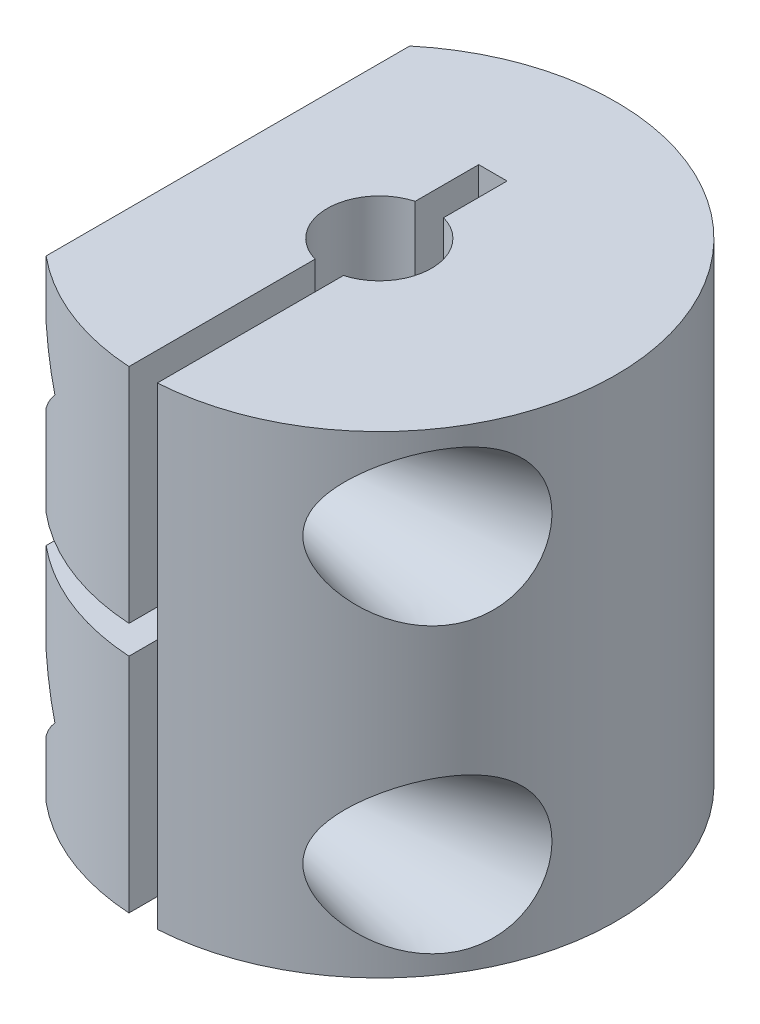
from build123d import *

# Parameters (mm, degrees)
SKETCH1_R                    = 12.5
BOSS_EXTRUDE1_DEPTH          = 25
SKETCH2_R                    = 2.75
CUT_EXTRUDE1_DEPTH           = 31.618621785
SKETCH3_W                    = 1.5
SKETCH3_H                    = 19
CUT_EXTRUDE2_DEPTH           = 31.618621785
SKETCH4_R                    = 1.5
CUT_EXTRUDE3_DEPTH           = 15
CUT_EXTRUDE3_TAPER           = -15
CUT_EXTRUDE3_OTHER_WAY_DEPTH = 31.932385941
SKETCH11_W                   = 18.477479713
SKETCH11_H                   = 1.5
CUT_EXTRUDE4_DEPTH           = 31.932386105
CUT_EXTRUDE5_DEPTH           = 31.618621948
CUT_EXTRUDE6_DEPTH           = 3


with BuildPart() as part:
    # Sketch1 → Boss-Extrude1 (new body)
    with BuildSketch(Plane(origin=(0, 0, 0), x_dir=(1, 0, 0), z_dir=(0, 1, 0))):
        with Locations(Location((0, 0, 0), (0, 0, 270))):
            Circle(SKETCH1_R)
    extrude(amount=BOSS_EXTRUDE1_DEPTH)

    # Sketch2 → Cut-Extrude1 (cut, through all)
    with BuildSketch(Plane(origin=(0, 25, 0), x_dir=(1, 0, 0), z_dir=(0, 1, 0))):
        with Locations(Location((0, 0, 0), (0, 0, 270))):
            Circle(SKETCH2_R)
    extrude(amount=-CUT_EXTRUDE1_DEPTH, mode=Mode.SUBTRACT)

    # Sketch3 → Cut-Extrude2 (cut, through all)
    with BuildSketch(Plane(origin=(0, 25, 0), x_dir=(1, 0, 0), z_dir=(0, 1, 0))):
        with Locations((0, -3.5)):
            Rectangle(SKETCH3_W, SKETCH3_H)
    extrude(amount=-CUT_EXTRUDE2_DEPTH, mode=Mode.SUBTRACT)

    # Sketch4 → Cut-Extrude3 (cut)
    with BuildSketch(Plane.ZY.offset(-0.75)):
        with Locations(Location((7.561615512, 20, 0), (0, 0, 180))):
            Circle(SKETCH4_R)
        with Locations(Location((7.561615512, 5, 0), (0, 0, 180))):
            Circle(SKETCH4_R)
    extrude(amount=-CUT_EXTRUDE3_DEPTH, taper=CUT_EXTRUDE3_TAPER, mode=Mode.SUBTRACT)

    # Sketch4 → Cut-Extrude3 other way (cut)
    with BuildSketch(Plane.ZY.offset(-0.75)):
        with Locations(Location((7.561615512, 20, 0), (0, 0, 180))):
            Circle(SKETCH4_R)
        with Locations(Location((7.561615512, 5, 0), (0, 0, 180))):
            Circle(SKETCH4_R)
    extrude(amount=CUT_EXTRUDE3_OTHER_WAY_DEPTH, mode=Mode.SUBTRACT)

    # Sketch11 → Cut-Extrude4 (cut, through all)
    with BuildSketch(Plane.ZY.offset(-0.75)):
        with Locations((3.238739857, 12.5)):
            Rectangle(SKETCH11_W, SKETCH11_H)
    extrude(amount=CUT_EXTRUDE4_DEPTH, mode=Mode.SUBTRACT)

    # Sketch12 → Cut-Extrude5 (cut, through all)
    with BuildSketch(Plane(origin=(0, 25, 0), x_dir=(1, 0, 0), z_dir=(0, 1, 0))):
        with BuildLine():
            Line((-8, 9.604686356), (-8, -9.604686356))
            ThreePointArc((-8, -9.604686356), (-12.5, 0), (-8, 9.604686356))
        make_face()
    extrude(amount=-CUT_EXTRUDE5_DEPTH, mode=Mode.SUBTRACT)

    # Sketch14 → Cut-Extrude6 (cut)
    with BuildSketch(Plane.ZY.offset(8)):
        Polygon((4.386189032, 20), (5.973902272, 17.25), (9.149328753, 17.25), (10.737041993, 20), (9.149328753, 22.75), (5.973902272, 22.75), align=None)
        Polygon((5.973902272, 2.25), (4.386189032, 5), (5.973902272, 7.75), (9.149328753, 7.75), (10.737041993, 5), (9.149328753, 2.25), align=None)
    extrude(amount=-CUT_EXTRUDE6_DEPTH, mode=Mode.SUBTRACT)


solid = part.part
